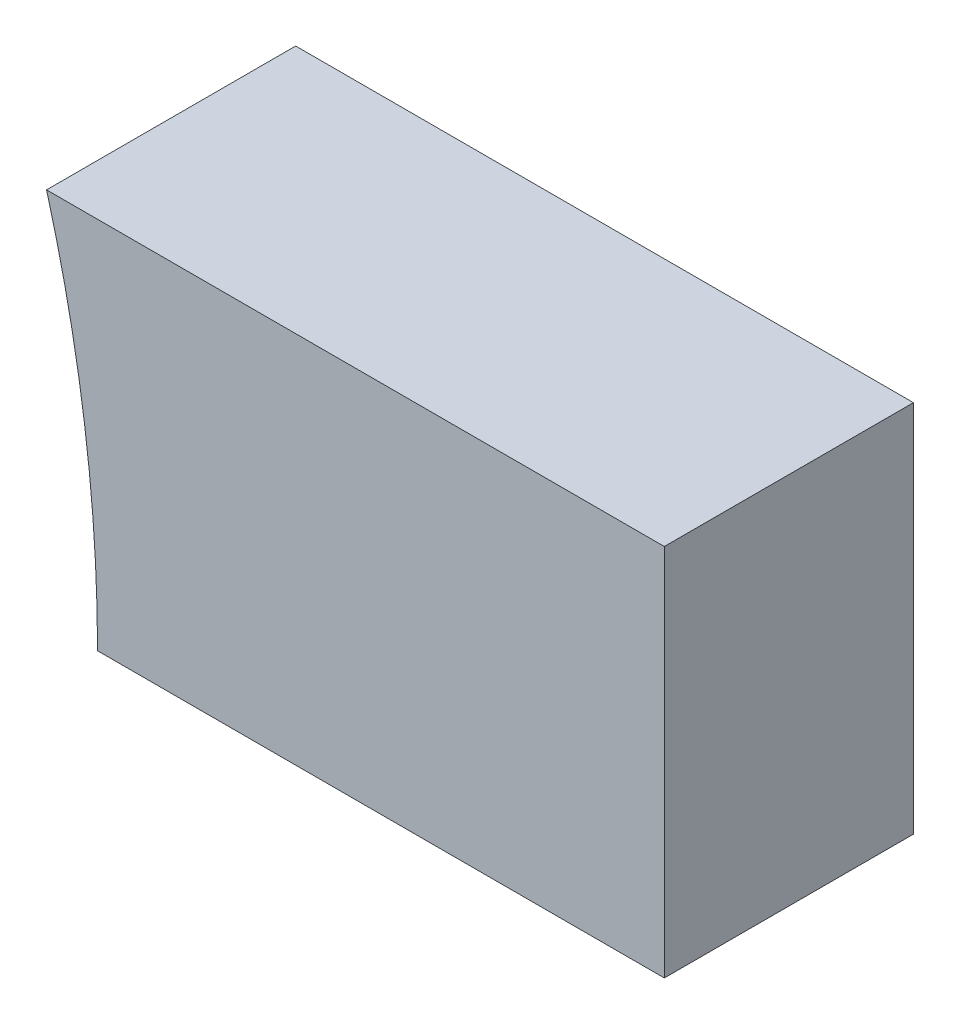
ISO-10303-21;
HEADER;
FILE_DESCRIPTION(('STEP AP214'),'2;1');
FILE_NAME('part.step','',(''),(''),'','','');
FILE_SCHEMA(('AUTOMOTIVE_DESIGN { 1 0 10303 214 1 1 1 1 }'));
ENDSEC;
DATA;
#1=APPLICATION_CONTEXT('core data for automotive mechanical design processes');
#2=APPLICATION_PROTOCOL_DEFINITION('international standard','automotive_design',2000,#1);
#3=PRODUCT_CONTEXT('',#1,'mechanical');
#4=PRODUCT('Part','Part','',(#3));
#5=PRODUCT_RELATED_PRODUCT_CATEGORY('part','',(#4));
#6=PRODUCT_DEFINITION_FORMATION('','',#4);
#7=PRODUCT_DEFINITION_CONTEXT('part definition',#1,'design');
#8=PRODUCT_DEFINITION('design','',#6,#7);
#9=PRODUCT_DEFINITION_SHAPE('','',#8);
#10=(LENGTH_UNIT() NAMED_UNIT(*) SI_UNIT(.MILLI.,.METRE.));
#11=(NAMED_UNIT(*) PLANE_ANGLE_UNIT() SI_UNIT($,.RADIAN.));
#12=(NAMED_UNIT(*) SI_UNIT($,.STERADIAN.) SOLID_ANGLE_UNIT());
#13=UNCERTAINTY_MEASURE_WITH_UNIT(LENGTH_MEASURE(1.E-05),#10,'distance_accuracy_value','');
#14=(GEOMETRIC_REPRESENTATION_CONTEXT(3) GLOBAL_UNCERTAINTY_ASSIGNED_CONTEXT((#13)) GLOBAL_UNIT_ASSIGNED_CONTEXT((#10,
#11,#12)) REPRESENTATION_CONTEXT('',''));
#15=CARTESIAN_POINT('',(0.,0.,0.));
#16=DIRECTION('',(0.,0.,1.));
#17=DIRECTION('',(1.,0.,0.));
#18=AXIS2_PLACEMENT_3D('',#15,#16,#17);
#19=CARTESIAN_POINT('',(0.,0.,20.));
#20=DIRECTION('',(0.,0.,-1.));
#21=DIRECTION('',(-1.,0.,0.));
#22=AXIS2_PLACEMENT_3D('',#19,#20,#21);
#23=CYLINDRICAL_SURFACE('',#22,112.);
#24=CARTESIAN_POINT('',(0.,0.,0.));
#25=DIRECTION('',(0.,0.,-1.));
#26=DIRECTION('',(1.,0.,0.));
#27=AXIS2_PLACEMENT_3D('',#24,#25,#26);
#28=CIRCLE('',#27,112.);
#29=CARTESIAN_POINT('',(107.90736768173,30.,0.));
#30=VERTEX_POINT('',#29);
#31=CARTESIAN_POINT('',(112.,0.,0.));
#32=VERTEX_POINT('',#31);
#33=EDGE_CURVE('E70',#30,#32,#28,.T.);
#34=ORIENTED_EDGE('',*,*,#33,.T.);
#35=DIRECTION('',(0.,0.,-1.));
#36=VECTOR('',#35,1.);
#37=CARTESIAN_POINT('',(112.,0.,20.));
#38=LINE('',#37,#36);
#39=CARTESIAN_POINT('',(112.,0.,20.));
#40=VERTEX_POINT('',#39);
#41=EDGE_CURVE('E11',#40,#32,#38,.T.);
#42=ORIENTED_EDGE('',*,*,#41,.F.);
#43=CARTESIAN_POINT('',(0.,0.,20.));
#44=DIRECTION('',(0.,0.,-1.));
#45=DIRECTION('',(1.,0.,0.));
#46=AXIS2_PLACEMENT_3D('',#43,#44,#45);
#47=CIRCLE('',#46,112.);
#48=CARTESIAN_POINT('',(107.90736768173,30.,20.));
#49=VERTEX_POINT('',#48);
#50=EDGE_CURVE('E88',#49,#40,#47,.T.);
#51=ORIENTED_EDGE('',*,*,#50,.F.);
#52=DIRECTION('',(0.,0.,-1.));
#53=VECTOR('',#52,1.);
#54=CARTESIAN_POINT('',(107.90736768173,30.,20.));
#55=LINE('',#54,#53);
#56=EDGE_CURVE('E82',#49,#30,#55,.T.);
#57=ORIENTED_EDGE('',*,*,#56,.T.);
#58=EDGE_LOOP('',(#34,#42,#51,#57));
#59=FACE_BOUND('',#58,.T.);
#60=ADVANCED_FACE('F26',(#59),#23,.F.);
#61=CARTESIAN_POINT('',(157.5,0.,20.));
#62=DIRECTION('',(0.,1.,0.));
#63=DIRECTION('',(0.,0.,1.));
#64=AXIS2_PLACEMENT_3D('',#61,#62,#63);
#65=PLANE('',#64);
#66=DIRECTION('',(1.,0.,0.));
#67=VECTOR('',#66,1.);
#68=CARTESIAN_POINT('',(157.5,0.,0.));
#69=LINE('',#68,#67);
#70=CARTESIAN_POINT('',(157.5,0.,0.));
#71=VERTEX_POINT('',#70);
#72=EDGE_CURVE('E66',#32,#71,#69,.T.);
#73=ORIENTED_EDGE('',*,*,#72,.T.);
#74=DIRECTION('',(0.,0.,-1.));
#75=VECTOR('',#74,1.);
#76=CARTESIAN_POINT('',(157.5,0.,20.));
#77=LINE('',#76,#75);
#78=CARTESIAN_POINT('',(157.5,0.,20.));
#79=VERTEX_POINT('',#78);
#80=EDGE_CURVE('E33',#79,#71,#77,.T.);
#81=ORIENTED_EDGE('',*,*,#80,.F.);
#82=DIRECTION('',(1.,0.,0.));
#83=VECTOR('',#82,1.);
#84=CARTESIAN_POINT('',(157.5,0.,20.));
#85=LINE('',#84,#83);
#86=EDGE_CURVE('E78',#40,#79,#85,.T.);
#87=ORIENTED_EDGE('',*,*,#86,.F.);
#88=ORIENTED_EDGE('',*,*,#41,.T.);
#89=EDGE_LOOP('',(#73,#81,#87,#88));
#90=FACE_BOUND('',#89,.T.);
#91=ADVANCED_FACE('F77',(#90),#65,.F.);
#92=CARTESIAN_POINT('',(157.5,30.,20.));
#93=DIRECTION('',(-1.,0.,0.));
#94=DIRECTION('',(0.,-1.,0.));
#95=AXIS2_PLACEMENT_3D('',#92,#93,#94);
#96=PLANE('',#95);
#97=DIRECTION('',(0.,1.,0.));
#98=VECTOR('',#97,1.);
#99=CARTESIAN_POINT('',(157.5,30.,0.));
#100=LINE('',#99,#98);
#101=CARTESIAN_POINT('',(157.5,30.,0.));
#102=VERTEX_POINT('',#101);
#103=EDGE_CURVE('E71',#71,#102,#100,.T.);
#104=ORIENTED_EDGE('',*,*,#103,.T.);
#105=DIRECTION('',(0.,0.,-1.));
#106=VECTOR('',#105,1.);
#107=CARTESIAN_POINT('',(157.5,30.,20.));
#108=LINE('',#107,#106);
#109=CARTESIAN_POINT('',(157.5,30.,20.));
#110=VERTEX_POINT('',#109);
#111=EDGE_CURVE('E94',#110,#102,#108,.T.);
#112=ORIENTED_EDGE('',*,*,#111,.F.);
#113=DIRECTION('',(0.,1.,0.));
#114=VECTOR('',#113,1.);
#115=CARTESIAN_POINT('',(157.5,30.,20.));
#116=LINE('',#115,#114);
#117=EDGE_CURVE('E45',#79,#110,#116,.T.);
#118=ORIENTED_EDGE('',*,*,#117,.F.);
#119=ORIENTED_EDGE('',*,*,#80,.T.);
#120=EDGE_LOOP('',(#104,#112,#118,#119));
#121=FACE_BOUND('',#120,.T.);
#122=ADVANCED_FACE('F97',(#121),#96,.F.);
#123=CARTESIAN_POINT('',(107.90736768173,30.,20.));
#124=DIRECTION('',(0.,-1.,0.));
#125=DIRECTION('',(0.,0.,-1.));
#126=AXIS2_PLACEMENT_3D('',#123,#124,#125);
#127=PLANE('',#126);
#128=DIRECTION('',(-1.,0.,0.));
#129=VECTOR('',#128,1.);
#130=CARTESIAN_POINT('',(107.90736768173,30.,0.));
#131=LINE('',#130,#129);
#132=EDGE_CURVE('E86',#102,#30,#131,.T.);
#133=ORIENTED_EDGE('',*,*,#132,.T.);
#134=ORIENTED_EDGE('',*,*,#56,.F.);
#135=DIRECTION('',(-1.,0.,0.));
#136=VECTOR('',#135,1.);
#137=CARTESIAN_POINT('',(107.90736768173,30.,20.));
#138=LINE('',#137,#136);
#139=EDGE_CURVE('E40',#110,#49,#138,.T.);
#140=ORIENTED_EDGE('',*,*,#139,.F.);
#141=ORIENTED_EDGE('',*,*,#111,.T.);
#142=EDGE_LOOP('',(#133,#134,#140,#141));
#143=FACE_BOUND('',#142,.T.);
#144=ADVANCED_FACE('F99',(#143),#127,.F.);
#145=CARTESIAN_POINT('',(0.,0.,20.));
#146=DIRECTION('',(0.,0.,1.));
#147=DIRECTION('',(1.,0.,0.));
#148=AXIS2_PLACEMENT_3D('',#145,#146,#147);
#149=PLANE('',#148);
#150=ORIENTED_EDGE('',*,*,#50,.T.);
#151=ORIENTED_EDGE('',*,*,#86,.T.);
#152=ORIENTED_EDGE('',*,*,#117,.T.);
#153=ORIENTED_EDGE('',*,*,#139,.T.);
#154=EDGE_LOOP('',(#150,#151,#152,#153));
#155=FACE_BOUND('',#154,.T.);
#156=ADVANCED_FACE('F100',(#155),#149,.T.);
#157=CARTESIAN_POINT('',(0.,0.,0.));
#158=DIRECTION('',(0.,0.,1.));
#159=DIRECTION('',(1.,0.,0.));
#160=AXIS2_PLACEMENT_3D('',#157,#158,#159);
#161=PLANE('',#160);
#162=ORIENTED_EDGE('',*,*,#33,.F.);
#163=ORIENTED_EDGE('',*,*,#132,.F.);
#164=ORIENTED_EDGE('',*,*,#103,.F.);
#165=ORIENTED_EDGE('',*,*,#72,.F.);
#166=EDGE_LOOP('',(#162,#163,#164,#165));
#167=FACE_BOUND('',#166,.T.);
#168=ADVANCED_FACE('F67',(#167),#161,.F.);
#169=CLOSED_SHELL('',(#60,#91,#122,#144,#156,#168));
#170=MANIFOLD_SOLID_BREP('B2',#169);
#171=ADVANCED_BREP_SHAPE_REPRESENTATION('',(#18,#170),#14);
#172=SHAPE_DEFINITION_REPRESENTATION(#9,#171);
ENDSEC;
END-ISO-10303-21;
